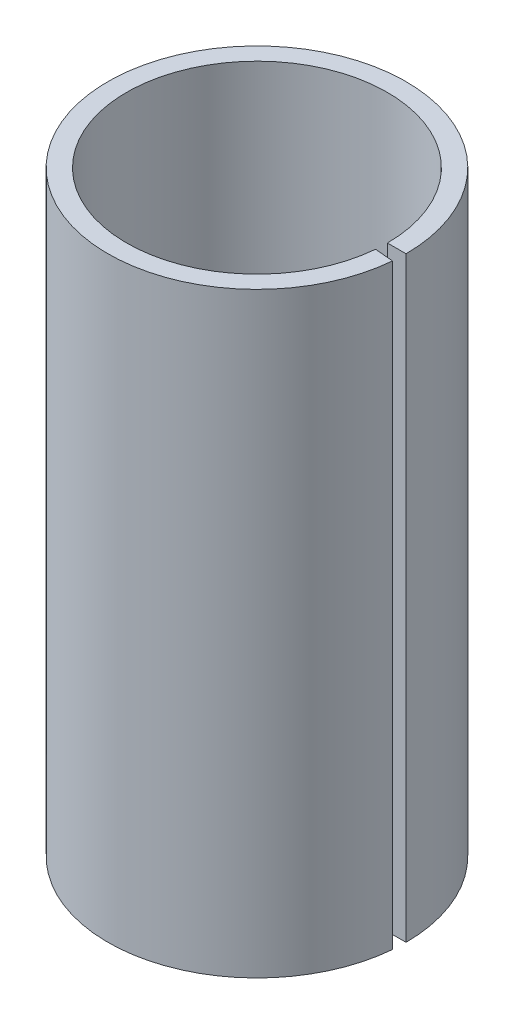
ISO-10303-21;
HEADER;
FILE_DESCRIPTION(('STEP AP214'),'2;1');
FILE_NAME('part.step','',(''),(''),'','','');
FILE_SCHEMA(('AUTOMOTIVE_DESIGN { 1 0 10303 214 1 1 1 1 }'));
ENDSEC;
DATA;
#1=APPLICATION_CONTEXT('core data for automotive mechanical design processes');
#2=APPLICATION_PROTOCOL_DEFINITION('international standard','automotive_design',2000,#1);
#3=PRODUCT_CONTEXT('',#1,'mechanical');
#4=PRODUCT('Part','Part','',(#3));
#5=PRODUCT_RELATED_PRODUCT_CATEGORY('part','',(#4));
#6=PRODUCT_DEFINITION_FORMATION('','',#4);
#7=PRODUCT_DEFINITION_CONTEXT('part definition',#1,'design');
#8=PRODUCT_DEFINITION('design','',#6,#7);
#9=PRODUCT_DEFINITION_SHAPE('','',#8);
#10=(LENGTH_UNIT() NAMED_UNIT(*) SI_UNIT(.MILLI.,.METRE.));
#11=(NAMED_UNIT(*) PLANE_ANGLE_UNIT() SI_UNIT($,.RADIAN.));
#12=(NAMED_UNIT(*) SI_UNIT($,.STERADIAN.) SOLID_ANGLE_UNIT());
#13=UNCERTAINTY_MEASURE_WITH_UNIT(LENGTH_MEASURE(1.E-05),#10,'distance_accuracy_value','');
#14=(GEOMETRIC_REPRESENTATION_CONTEXT(3) GLOBAL_UNCERTAINTY_ASSIGNED_CONTEXT((#13)) GLOBAL_UNIT_ASSIGNED_CONTEXT((#10,
#11,#12)) REPRESENTATION_CONTEXT('',''));
#15=CARTESIAN_POINT('',(0.,0.,0.));
#16=DIRECTION('',(0.,0.,1.));
#17=DIRECTION('',(1.,0.,0.));
#18=AXIS2_PLACEMENT_3D('',#15,#16,#17);
#19=CARTESIAN_POINT('',(3.48668144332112,-0.119752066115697,0.305045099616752));
#20=DIRECTION('',(0.,-1.,0.));
#21=DIRECTION('',(0.,0.,-1.));
#22=AXIS2_PLACEMENT_3D('',#19,#20,#21);
#23=PLANE('',#22);
#24=CARTESIAN_POINT('',(0.,-0.119752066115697,0.));
#25=DIRECTION('',(0.,-1.,0.));
#26=DIRECTION('',(0.,0.,-1.));
#27=AXIS2_PLACEMENT_3D('',#24,#25,#26);
#28=CIRCLE('',#27,4.);
#29=CARTESIAN_POINT('',(3.98477879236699,-0.119752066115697,0.348622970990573));
#30=VERTEX_POINT('',#29);
#31=CARTESIAN_POINT('',(4.,-0.119752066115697,0.));
#32=VERTEX_POINT('',#31);
#33=EDGE_CURVE('E11',#30,#32,#28,.T.);
#34=ORIENTED_EDGE('',*,*,#33,.T.);
#35=DIRECTION('',(1.,0.,0.));
#36=VECTOR('',#35,1.);
#37=CARTESIAN_POINT('',(3.5,-0.119752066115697,0.));
#38=LINE('',#37,#36);
#39=CARTESIAN_POINT('',(3.5,-0.119752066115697,0.));
#40=VERTEX_POINT('',#39);
#41=EDGE_CURVE('E80',#40,#32,#38,.T.);
#42=ORIENTED_EDGE('',*,*,#41,.F.);
#43=CARTESIAN_POINT('',(0.,-0.119752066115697,0.));
#44=DIRECTION('',(0.,-1.,0.));
#45=DIRECTION('',(0.,0.,-1.));
#46=AXIS2_PLACEMENT_3D('',#43,#44,#45);
#47=CIRCLE('',#46,3.5);
#48=CARTESIAN_POINT('',(3.48668144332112,-0.119752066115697,0.305045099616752));
#49=VERTEX_POINT('',#48);
#50=EDGE_CURVE('E55',#49,#40,#47,.T.);
#51=ORIENTED_EDGE('',*,*,#50,.F.);
#52=DIRECTION('',(0.996194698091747,0.,0.0871557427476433));
#53=VECTOR('',#52,1.);
#54=CARTESIAN_POINT('',(3.48668144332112,-0.119752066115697,0.305045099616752));
#55=LINE('',#54,#53);
#56=EDGE_CURVE('E82',#49,#30,#55,.T.);
#57=ORIENTED_EDGE('',*,*,#56,.T.);
#58=EDGE_LOOP('',(#34,#42,#51,#57));
#59=FACE_BOUND('',#58,.T.);
#60=ADVANCED_FACE('F40',(#59),#23,.T.);
#61=CARTESIAN_POINT('',(0.,-10.8842148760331,0.));
#62=DIRECTION('',(0.,-1.,0.));
#63=DIRECTION('',(0.,0.,-1.));
#64=AXIS2_PLACEMENT_3D('',#61,#62,#63);
#65=CYLINDRICAL_SURFACE('',#64,4.);
#66=CARTESIAN_POINT('',(0.,15.8802479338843,0.));
#67=DIRECTION('',(0.,-1.,0.));
#68=DIRECTION('',(0.,0.,-1.));
#69=AXIS2_PLACEMENT_3D('',#66,#67,#68);
#70=CIRCLE('',#69,4.);
#71=CARTESIAN_POINT('',(3.98477879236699,15.8802479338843,0.348622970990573));
#72=VERTEX_POINT('',#71);
#73=CARTESIAN_POINT('',(4.,15.8802479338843,0.));
#74=VERTEX_POINT('',#73);
#75=EDGE_CURVE('E48',#72,#74,#70,.T.);
#76=ORIENTED_EDGE('',*,*,#75,.T.);
#77=DIRECTION('',(0.,1.,0.));
#78=VECTOR('',#77,1.);
#79=CARTESIAN_POINT('',(4.,-0.119752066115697,0.));
#80=LINE('',#79,#78);
#81=EDGE_CURVE('E91',#32,#74,#80,.T.);
#82=ORIENTED_EDGE('',*,*,#81,.F.);
#83=ORIENTED_EDGE('',*,*,#33,.F.);
#84=DIRECTION('',(0.,1.,0.));
#85=VECTOR('',#84,1.);
#86=CARTESIAN_POINT('',(3.98477879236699,-0.119752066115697,0.348622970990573));
#87=LINE('',#86,#85);
#88=EDGE_CURVE('E101',#30,#72,#87,.T.);
#89=ORIENTED_EDGE('',*,*,#88,.T.);
#90=EDGE_LOOP('',(#76,#82,#83,#89));
#91=FACE_BOUND('',#90,.T.);
#92=ADVANCED_FACE('F42',(#91),#65,.T.);
#93=CARTESIAN_POINT('',(3.98477879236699,15.8802479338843,0.348622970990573));
#94=DIRECTION('',(0.,1.,0.));
#95=DIRECTION('',(0.,0.,1.));
#96=AXIS2_PLACEMENT_3D('',#93,#94,#95);
#97=PLANE('',#96);
#98=CARTESIAN_POINT('',(0.,15.8802479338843,0.));
#99=DIRECTION('',(0.,-1.,0.));
#100=DIRECTION('',(0.,0.,-1.));
#101=AXIS2_PLACEMENT_3D('',#98,#99,#100);
#102=CIRCLE('',#101,3.5);
#103=CARTESIAN_POINT('',(3.48668144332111,15.8802479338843,0.305045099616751));
#104=VERTEX_POINT('',#103);
#105=CARTESIAN_POINT('',(3.5,15.8802479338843,0.));
#106=VERTEX_POINT('',#105);
#107=EDGE_CURVE('E63',#104,#106,#102,.T.);
#108=ORIENTED_EDGE('',*,*,#107,.T.);
#109=DIRECTION('',(-1.,0.,0.));
#110=VECTOR('',#109,1.);
#111=CARTESIAN_POINT('',(4.,15.8802479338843,0.));
#112=LINE('',#111,#110);
#113=EDGE_CURVE('E95',#74,#106,#112,.T.);
#114=ORIENTED_EDGE('',*,*,#113,.F.);
#115=ORIENTED_EDGE('',*,*,#75,.F.);
#116=DIRECTION('',(-0.996194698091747,0.,-0.0871557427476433));
#117=VECTOR('',#116,1.);
#118=CARTESIAN_POINT('',(3.98477879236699,15.8802479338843,0.348622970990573));
#119=LINE('',#118,#117);
#120=EDGE_CURVE('E103',#72,#104,#119,.T.);
#121=ORIENTED_EDGE('',*,*,#120,.T.);
#122=EDGE_LOOP('',(#108,#114,#115,#121));
#123=FACE_BOUND('',#122,.T.);
#124=ADVANCED_FACE('F109',(#123),#97,.T.);
#125=CARTESIAN_POINT('',(0.,-10.8842148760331,0.));
#126=DIRECTION('',(0.,-1.,0.));
#127=DIRECTION('',(0.,0.,-1.));
#128=AXIS2_PLACEMENT_3D('',#125,#126,#127);
#129=CYLINDRICAL_SURFACE('',#128,3.5);
#130=DIRECTION('',(0.,-1.,0.));
#131=VECTOR('',#130,1.);
#132=CARTESIAN_POINT('',(3.48668144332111,15.8802479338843,0.305045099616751));
#133=LINE('',#132,#131);
#134=EDGE_CURVE('E105',#104,#49,#133,.T.);
#135=ORIENTED_EDGE('',*,*,#134,.T.);
#136=ORIENTED_EDGE('',*,*,#50,.T.);
#137=DIRECTION('',(0.,-1.,0.));
#138=VECTOR('',#137,1.);
#139=CARTESIAN_POINT('',(3.5,15.8802479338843,0.));
#140=LINE('',#139,#138);
#141=EDGE_CURVE('E93',#106,#40,#140,.T.);
#142=ORIENTED_EDGE('',*,*,#141,.F.);
#143=ORIENTED_EDGE('',*,*,#107,.F.);
#144=EDGE_LOOP('',(#135,#136,#142,#143));
#145=FACE_BOUND('',#144,.T.);
#146=ADVANCED_FACE('F112',(#145),#129,.F.);
#147=CARTESIAN_POINT('',(3.98477879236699,-0.119752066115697,0.348622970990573));
#148=DIRECTION('',(-0.0871557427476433,0.,0.996194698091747));
#149=DIRECTION('',(0.996194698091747,0.,0.0871557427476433));
#150=AXIS2_PLACEMENT_3D('',#147,#148,#149);
#151=PLANE('',#150);
#152=ORIENTED_EDGE('',*,*,#56,.F.);
#153=ORIENTED_EDGE('',*,*,#134,.F.);
#154=ORIENTED_EDGE('',*,*,#120,.F.);
#155=ORIENTED_EDGE('',*,*,#88,.F.);
#156=EDGE_LOOP('',(#152,#153,#154,#155));
#157=FACE_BOUND('',#156,.T.);
#158=ADVANCED_FACE('F114',(#157),#151,.F.);
#159=CARTESIAN_POINT('',(4.,-0.119752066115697,0.));
#160=DIRECTION('',(0.,0.,1.));
#161=DIRECTION('',(1.,0.,0.));
#162=AXIS2_PLACEMENT_3D('',#159,#160,#161);
#163=PLANE('',#162);
#164=ORIENTED_EDGE('',*,*,#41,.T.);
#165=ORIENTED_EDGE('',*,*,#81,.T.);
#166=ORIENTED_EDGE('',*,*,#113,.T.);
#167=ORIENTED_EDGE('',*,*,#141,.T.);
#168=EDGE_LOOP('',(#164,#165,#166,#167));
#169=FACE_BOUND('',#168,.T.);
#170=ADVANCED_FACE('F89',(#169),#163,.T.);
#171=CLOSED_SHELL('',(#60,#92,#124,#146,#158,#170));
#172=MANIFOLD_SOLID_BREP('B2',#171);
#173=ADVANCED_BREP_SHAPE_REPRESENTATION('',(#18,#172),#14);
#174=SHAPE_DEFINITION_REPRESENTATION(#9,#173);
ENDSEC;
END-ISO-10303-21;
